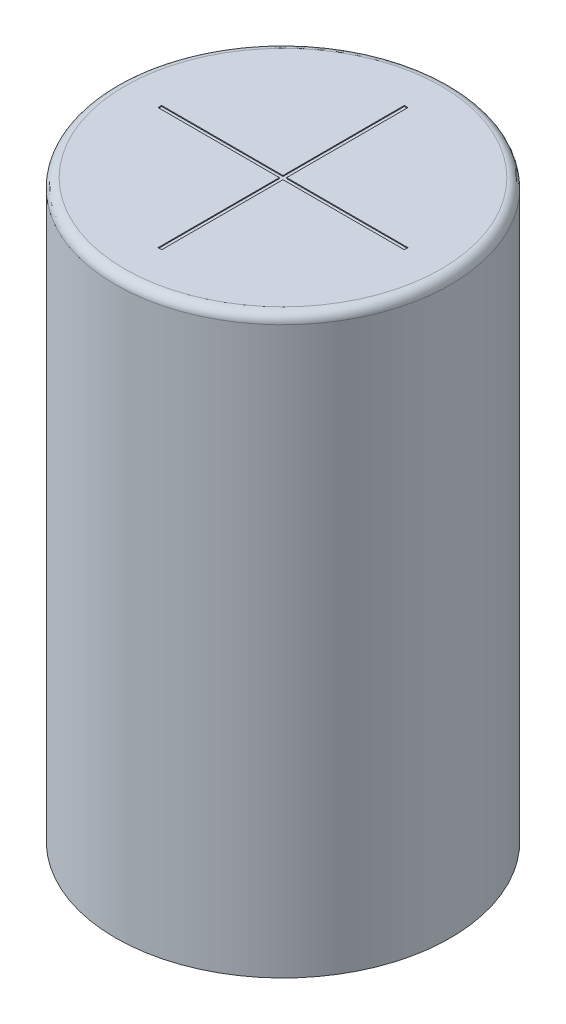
ISO-10303-21;
HEADER;
FILE_DESCRIPTION(('STEP AP214'),'2;1');
FILE_NAME('part.step','',(''),(''),'','','');
FILE_SCHEMA(('AUTOMOTIVE_DESIGN { 1 0 10303 214 1 1 1 1 }'));
ENDSEC;
DATA;
#1=APPLICATION_CONTEXT('core data for automotive mechanical design processes');
#2=APPLICATION_PROTOCOL_DEFINITION('international standard','automotive_design',2000,#1);
#3=PRODUCT_CONTEXT('',#1,'mechanical');
#4=PRODUCT('Part','Part','',(#3));
#5=PRODUCT_RELATED_PRODUCT_CATEGORY('part','',(#4));
#6=PRODUCT_DEFINITION_FORMATION('','',#4);
#7=PRODUCT_DEFINITION_CONTEXT('part definition',#1,'design');
#8=PRODUCT_DEFINITION('design','',#6,#7);
#9=PRODUCT_DEFINITION_SHAPE('','',#8);
#10=(LENGTH_UNIT() NAMED_UNIT(*) SI_UNIT(.MILLI.,.METRE.));
#11=(NAMED_UNIT(*) PLANE_ANGLE_UNIT() SI_UNIT($,.RADIAN.));
#12=(NAMED_UNIT(*) SI_UNIT($,.STERADIAN.) SOLID_ANGLE_UNIT());
#13=UNCERTAINTY_MEASURE_WITH_UNIT(LENGTH_MEASURE(1.E-05),#10,'distance_accuracy_value','');
#14=(GEOMETRIC_REPRESENTATION_CONTEXT(3) GLOBAL_UNCERTAINTY_ASSIGNED_CONTEXT((#13)) GLOBAL_UNIT_ASSIGNED_CONTEXT((#10,
#11,#12)) REPRESENTATION_CONTEXT('',''));
#15=CARTESIAN_POINT('',(0.,0.,0.));
#16=DIRECTION('',(0.,0.,1.));
#17=DIRECTION('',(1.,0.,0.));
#18=AXIS2_PLACEMENT_3D('',#15,#16,#17);
#19=CARTESIAN_POINT('',(0.,31.45,0.));
#20=DIRECTION('',(0.,1.,0.));
#21=DIRECTION('',(0.,0.,1.));
#22=AXIS2_PLACEMENT_3D('',#19,#20,#21);
#23=CYLINDRICAL_SURFACE('',#22,6.75);
#24=CARTESIAN_POINT('',(0.,31.45,0.));
#25=DIRECTION('',(0.,1.,0.));
#26=DIRECTION('',(0.,0.,1.));
#27=AXIS2_PLACEMENT_3D('',#24,#25,#26);
#28=CIRCLE('',#27,6.75);
#29=CARTESIAN_POINT('',(-0.1,31.45,6.74925921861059));
#30=VERTEX_POINT('',#29);
#31=CARTESIAN_POINT('',(0.100000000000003,31.45,6.74925921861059));
#32=VERTEX_POINT('',#31);
#33=EDGE_CURVE('E103',#30,#32,#28,.T.);
#34=ORIENTED_EDGE('',*,*,#33,.F.);
#35=DIRECTION('',(0.,1.,0.));
#36=VECTOR('',#35,1.);
#37=CARTESIAN_POINT('',(-0.1,31.45,6.74925921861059));
#38=LINE('',#37,#36);
#39=CARTESIAN_POINT('',(-0.1,31.5,6.74925921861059));
#40=VERTEX_POINT('',#39);
#41=EDGE_CURVE('E114',#30,#40,#38,.T.);
#42=ORIENTED_EDGE('',*,*,#41,.T.);
#43=CARTESIAN_POINT('',(0.,31.5,0.));
#44=DIRECTION('',(0.,1.,0.));
#45=DIRECTION('',(0.,0.,1.));
#46=AXIS2_PLACEMENT_3D('',#43,#44,#45);
#47=CIRCLE('',#46,6.75);
#48=CARTESIAN_POINT('',(0.100000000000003,31.5,6.74925921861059));
#49=VERTEX_POINT('',#48);
#50=EDGE_CURVE('E11',#40,#49,#47,.T.);
#51=ORIENTED_EDGE('',*,*,#50,.T.);
#52=DIRECTION('',(0.,1.,0.));
#53=VECTOR('',#52,1.);
#54=CARTESIAN_POINT('',(0.100000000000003,31.45,6.74925921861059));
#55=LINE('',#54,#53);
#56=EDGE_CURVE('E36',#32,#49,#55,.T.);
#57=ORIENTED_EDGE('',*,*,#56,.F.);
#58=EDGE_LOOP('',(#34,#42,#51,#57));
#59=FACE_BOUND('',#58,.T.);
#60=ADVANCED_FACE('F17',(#59),#23,.F.);
#61=CARTESIAN_POINT('',(0.,31.,0.));
#62=DIRECTION('',(0.,1.,0.));
#63=DIRECTION('',(0.,0.,1.));
#64=AXIS2_PLACEMENT_3D('',#61,#62,#63);
#65=TOROIDAL_SURFACE('',#64,8.675,0.5);
#66=CARTESIAN_POINT('',(0.,31.5,0.));
#67=DIRECTION('',(0.,1.,0.));
#68=DIRECTION('',(0.,0.,1.));
#69=AXIS2_PLACEMENT_3D('',#66,#67,#68);
#70=CIRCLE('',#69,8.675);
#71=CARTESIAN_POINT('',(0.,31.5,8.675));
#72=VERTEX_POINT('',#71);
#73=EDGE_CURVE('E196',#72,#72,#70,.T.);
#74=ORIENTED_EDGE('',*,*,#73,.F.);
#75=EDGE_LOOP('',(#74));
#76=FACE_BOUND('',#75,.T.);
#77=CARTESIAN_POINT('',(0.,31.,0.));
#78=DIRECTION('',(0.,-1.,0.));
#79=DIRECTION('',(0.,0.,1.));
#80=AXIS2_PLACEMENT_3D('',#77,#78,#79);
#81=CIRCLE('',#80,9.175);
#82=CARTESIAN_POINT('',(0.,31.,9.175));
#83=VERTEX_POINT('',#82);
#84=EDGE_CURVE('E27',#83,#83,#81,.T.);
#85=ORIENTED_EDGE('',*,*,#84,.F.);
#86=EDGE_LOOP('',(#85));
#87=FACE_BOUND('',#86,.T.);
#88=ADVANCED_FACE('F252',(#76,#87),#65,.T.);
#89=CARTESIAN_POINT('',(0.,31.5,0.));
#90=DIRECTION('',(0.,-1.,0.));
#91=DIRECTION('',(0.,0.,-1.));
#92=AXIS2_PLACEMENT_3D('',#89,#90,#91);
#93=CYLINDRICAL_SURFACE('',#92,9.175);
#94=CARTESIAN_POINT('',(0.,0.,0.));
#95=DIRECTION('',(0.,1.,0.));
#96=DIRECTION('',(0.,0.,1.));
#97=AXIS2_PLACEMENT_3D('',#94,#95,#96);
#98=CIRCLE('',#97,9.175);
#99=CARTESIAN_POINT('',(0.,0.,9.175));
#100=VERTEX_POINT('',#99);
#101=EDGE_CURVE('E203',#100,#100,#98,.T.);
#102=ORIENTED_EDGE('',*,*,#101,.T.);
#103=EDGE_LOOP('',(#102));
#104=FACE_BOUND('',#103,.T.);
#105=ORIENTED_EDGE('',*,*,#84,.T.);
#106=EDGE_LOOP('',(#105));
#107=FACE_BOUND('',#106,.T.);
#108=ADVANCED_FACE('F248',(#104,#107),#93,.T.);
#109=CARTESIAN_POINT('',(0.,31.5,0.));
#110=DIRECTION('',(0.,1.,0.));
#111=DIRECTION('',(0.,0.,1.));
#112=AXIS2_PLACEMENT_3D('',#109,#110,#111);
#113=PLANE('',#112);
#114=DIRECTION('',(-1.,0.,0.));
#115=VECTOR('',#114,1.);
#116=CARTESIAN_POINT('',(-0.1,31.5,-0.1));
#117=LINE('',#116,#115);
#118=CARTESIAN_POINT('',(-0.1,31.5,-0.1));
#119=VERTEX_POINT('',#118);
#120=CARTESIAN_POINT('',(-6.74925921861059,31.5,-0.1));
#121=VERTEX_POINT('',#120);
#122=EDGE_CURVE('E137',#119,#121,#117,.T.);
#123=ORIENTED_EDGE('',*,*,#122,.F.);
#124=DIRECTION('',(0.,0.,1.));
#125=VECTOR('',#124,1.);
#126=CARTESIAN_POINT('',(-0.1,31.5,-0.1));
#127=LINE('',#126,#125);
#128=CARTESIAN_POINT('',(-0.0999999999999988,31.5,-6.74925921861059));
#129=VERTEX_POINT('',#128);
#130=EDGE_CURVE('E144',#129,#119,#127,.T.);
#131=ORIENTED_EDGE('',*,*,#130,.F.);
#132=CARTESIAN_POINT('',(0.,31.5,0.));
#133=DIRECTION('',(0.,1.,0.));
#134=DIRECTION('',(0.,0.,1.));
#135=AXIS2_PLACEMENT_3D('',#132,#133,#134);
#136=CIRCLE('',#135,6.75);
#137=CARTESIAN_POINT('',(0.1,31.5,-6.74925921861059));
#138=VERTEX_POINT('',#137);
#139=EDGE_CURVE('E151',#138,#129,#136,.T.);
#140=ORIENTED_EDGE('',*,*,#139,.F.);
#141=DIRECTION('',(0.,0.,-1.));
#142=VECTOR('',#141,1.);
#143=CARTESIAN_POINT('',(0.1,31.5,-0.1));
#144=LINE('',#143,#142);
#145=CARTESIAN_POINT('',(0.1,31.5,-0.1));
#146=VERTEX_POINT('',#145);
#147=EDGE_CURVE('E158',#146,#138,#144,.T.);
#148=ORIENTED_EDGE('',*,*,#147,.F.);
#149=DIRECTION('',(-1.,0.,0.));
#150=VECTOR('',#149,1.);
#151=CARTESIAN_POINT('',(6.74925921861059,31.5,-0.1));
#152=LINE('',#151,#150);
#153=CARTESIAN_POINT('',(6.74925921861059,31.5,-0.100000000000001));
#154=VERTEX_POINT('',#153);
#155=EDGE_CURVE('E165',#154,#146,#152,.T.);
#156=ORIENTED_EDGE('',*,*,#155,.F.);
#157=CARTESIAN_POINT('',(0.,31.5,0.));
#158=DIRECTION('',(0.,1.,0.));
#159=DIRECTION('',(0.,0.,1.));
#160=AXIS2_PLACEMENT_3D('',#157,#158,#159);
#161=CIRCLE('',#160,6.75);
#162=CARTESIAN_POINT('',(6.74925921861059,31.5,0.1));
#163=VERTEX_POINT('',#162);
#164=EDGE_CURVE('E172',#163,#154,#161,.T.);
#165=ORIENTED_EDGE('',*,*,#164,.F.);
#166=DIRECTION('',(1.,0.,0.));
#167=VECTOR('',#166,1.);
#168=CARTESIAN_POINT('',(6.74925921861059,31.5,0.1));
#169=LINE('',#168,#167);
#170=CARTESIAN_POINT('',(0.1,31.5,0.1));
#171=VERTEX_POINT('',#170);
#172=EDGE_CURVE('E179',#171,#163,#169,.T.);
#173=ORIENTED_EDGE('',*,*,#172,.F.);
#174=DIRECTION('',(0.,0.,-1.));
#175=VECTOR('',#174,1.);
#176=CARTESIAN_POINT('',(0.1,31.5,6.74925921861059));
#177=LINE('',#176,#175);
#178=EDGE_CURVE('E186',#49,#171,#177,.T.);
#179=ORIENTED_EDGE('',*,*,#178,.F.);
#180=ORIENTED_EDGE('',*,*,#50,.F.);
#181=DIRECTION('',(0.,0.,1.));
#182=VECTOR('',#181,1.);
#183=CARTESIAN_POINT('',(-0.1,31.5,6.74925921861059));
#184=LINE('',#183,#182);
#185=CARTESIAN_POINT('',(-0.1,31.5,0.1));
#186=VERTEX_POINT('',#185);
#187=EDGE_CURVE('E124',#186,#40,#184,.T.);
#188=ORIENTED_EDGE('',*,*,#187,.F.);
#189=DIRECTION('',(1.,0.,0.));
#190=VECTOR('',#189,1.);
#191=CARTESIAN_POINT('',(-0.1,31.5,0.1));
#192=LINE('',#191,#190);
#193=CARTESIAN_POINT('',(-6.74925921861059,31.5,0.1));
#194=VERTEX_POINT('',#193);
#195=EDGE_CURVE('E122',#194,#186,#192,.T.);
#196=ORIENTED_EDGE('',*,*,#195,.F.);
#197=CARTESIAN_POINT('',(0.,31.5,0.));
#198=DIRECTION('',(0.,1.,0.));
#199=DIRECTION('',(0.,0.,1.));
#200=AXIS2_PLACEMENT_3D('',#197,#198,#199);
#201=CIRCLE('',#200,6.75);
#202=EDGE_CURVE('E136',#121,#194,#201,.T.);
#203=ORIENTED_EDGE('',*,*,#202,.F.);
#204=EDGE_LOOP('',(#123,#131,#140,#148,#156,#165,#173,#179,#180,#188,#196,#203));
#205=FACE_BOUND('',#204,.T.);
#206=ORIENTED_EDGE('',*,*,#73,.T.);
#207=EDGE_LOOP('',(#206));
#208=FACE_BOUND('',#207,.T.);
#209=ADVANCED_FACE('F244',(#205,#208),#113,.T.);
#210=CARTESIAN_POINT('',(0.,0.,0.));
#211=DIRECTION('',(0.,1.,0.));
#212=DIRECTION('',(0.,0.,1.));
#213=AXIS2_PLACEMENT_3D('',#210,#211,#212);
#214=PLANE('',#213);
#215=ORIENTED_EDGE('',*,*,#101,.F.);
#216=EDGE_LOOP('',(#215));
#217=FACE_BOUND('',#216,.T.);
#218=ADVANCED_FACE('F247',(#217),#214,.F.);
#219=CARTESIAN_POINT('',(0.,31.45,0.));
#220=DIRECTION('',(0.,1.,0.));
#221=DIRECTION('',(0.,0.,1.));
#222=AXIS2_PLACEMENT_3D('',#219,#220,#221);
#223=CYLINDRICAL_SURFACE('',#222,6.75);
#224=ORIENTED_EDGE('',*,*,#202,.T.);
#225=DIRECTION('',(0.,1.,0.));
#226=VECTOR('',#225,1.);
#227=CARTESIAN_POINT('',(-6.74925921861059,31.45,0.1));
#228=LINE('',#227,#226);
#229=CARTESIAN_POINT('',(-6.74925921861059,31.45,0.1));
#230=VERTEX_POINT('',#229);
#231=EDGE_CURVE('E128',#230,#194,#228,.T.);
#232=ORIENTED_EDGE('',*,*,#231,.F.);
#233=CARTESIAN_POINT('',(0.,31.45,0.));
#234=DIRECTION('',(0.,1.,0.));
#235=DIRECTION('',(0.,0.,1.));
#236=AXIS2_PLACEMENT_3D('',#233,#234,#235);
#237=CIRCLE('',#236,6.75);
#238=CARTESIAN_POINT('',(-6.74925921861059,31.45,-0.1));
#239=VERTEX_POINT('',#238);
#240=EDGE_CURVE('E126',#239,#230,#237,.T.);
#241=ORIENTED_EDGE('',*,*,#240,.F.);
#242=DIRECTION('',(0.,1.,0.));
#243=VECTOR('',#242,1.);
#244=CARTESIAN_POINT('',(-6.74925921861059,31.45,-0.1));
#245=LINE('',#244,#243);
#246=EDGE_CURVE('E133',#239,#121,#245,.T.);
#247=ORIENTED_EDGE('',*,*,#246,.T.);
#248=EDGE_LOOP('',(#224,#232,#241,#247));
#249=FACE_BOUND('',#248,.T.);
#250=ADVANCED_FACE('F242',(#249),#223,.F.);
#251=CARTESIAN_POINT('',(-0.1,31.45,-0.1));
#252=DIRECTION('',(0.,0.,-1.));
#253=DIRECTION('',(-1.,0.,0.));
#254=AXIS2_PLACEMENT_3D('',#251,#252,#253);
#255=PLANE('',#254);
#256=ORIENTED_EDGE('',*,*,#122,.T.);
#257=ORIENTED_EDGE('',*,*,#246,.F.);
#258=DIRECTION('',(-1.,0.,0.));
#259=VECTOR('',#258,1.);
#260=CARTESIAN_POINT('',(-0.1,31.45,-0.1));
#261=LINE('',#260,#259);
#262=CARTESIAN_POINT('',(-0.1,31.45,-0.1));
#263=VERTEX_POINT('',#262);
#264=EDGE_CURVE('E138',#263,#239,#261,.T.);
#265=ORIENTED_EDGE('',*,*,#264,.F.);
#266=DIRECTION('',(0.,1.,0.));
#267=VECTOR('',#266,1.);
#268=CARTESIAN_POINT('',(-0.1,31.45,-0.1));
#269=LINE('',#268,#267);
#270=EDGE_CURVE('E141',#263,#119,#269,.T.);
#271=ORIENTED_EDGE('',*,*,#270,.T.);
#272=EDGE_LOOP('',(#256,#257,#265,#271));
#273=FACE_BOUND('',#272,.T.);
#274=ADVANCED_FACE('F238',(#273),#255,.F.);
#275=CARTESIAN_POINT('',(-0.1,31.45,-0.1));
#276=DIRECTION('',(-1.,0.,0.));
#277=DIRECTION('',(0.,0.,1.));
#278=AXIS2_PLACEMENT_3D('',#275,#276,#277);
#279=PLANE('',#278);
#280=ORIENTED_EDGE('',*,*,#130,.T.);
#281=ORIENTED_EDGE('',*,*,#270,.F.);
#282=DIRECTION('',(0.,0.,1.));
#283=VECTOR('',#282,1.);
#284=CARTESIAN_POINT('',(-0.1,31.45,-0.1));
#285=LINE('',#284,#283);
#286=CARTESIAN_POINT('',(-0.0999999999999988,31.45,-6.74925921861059));
#287=VERTEX_POINT('',#286);
#288=EDGE_CURVE('E140',#287,#263,#285,.T.);
#289=ORIENTED_EDGE('',*,*,#288,.F.);
#290=DIRECTION('',(0.,1.,0.));
#291=VECTOR('',#290,1.);
#292=CARTESIAN_POINT('',(-0.0999999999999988,31.45,-6.74925921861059));
#293=LINE('',#292,#291);
#294=EDGE_CURVE('E148',#287,#129,#293,.T.);
#295=ORIENTED_EDGE('',*,*,#294,.T.);
#296=EDGE_LOOP('',(#280,#281,#289,#295));
#297=FACE_BOUND('',#296,.T.);
#298=ADVANCED_FACE('F234',(#297),#279,.F.);
#299=CARTESIAN_POINT('',(0.,31.45,0.));
#300=DIRECTION('',(0.,1.,0.));
#301=DIRECTION('',(0.,0.,1.));
#302=AXIS2_PLACEMENT_3D('',#299,#300,#301);
#303=CYLINDRICAL_SURFACE('',#302,6.75);
#304=ORIENTED_EDGE('',*,*,#139,.T.);
#305=ORIENTED_EDGE('',*,*,#294,.F.);
#306=CARTESIAN_POINT('',(0.,31.45,0.));
#307=DIRECTION('',(0.,1.,0.));
#308=DIRECTION('',(0.,0.,1.));
#309=AXIS2_PLACEMENT_3D('',#306,#307,#308);
#310=CIRCLE('',#309,6.75);
#311=CARTESIAN_POINT('',(0.1,31.45,-6.74925921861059));
#312=VERTEX_POINT('',#311);
#313=EDGE_CURVE('E147',#312,#287,#310,.T.);
#314=ORIENTED_EDGE('',*,*,#313,.F.);
#315=DIRECTION('',(0.,1.,0.));
#316=VECTOR('',#315,1.);
#317=CARTESIAN_POINT('',(0.1,31.45,-6.74925921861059));
#318=LINE('',#317,#316);
#319=EDGE_CURVE('E155',#312,#138,#318,.T.);
#320=ORIENTED_EDGE('',*,*,#319,.T.);
#321=EDGE_LOOP('',(#304,#305,#314,#320));
#322=FACE_BOUND('',#321,.T.);
#323=ADVANCED_FACE('F231',(#322),#303,.F.);
#324=CARTESIAN_POINT('',(0.1,31.45,-0.1));
#325=DIRECTION('',(1.,0.,0.));
#326=DIRECTION('',(0.,0.,-1.));
#327=AXIS2_PLACEMENT_3D('',#324,#325,#326);
#328=PLANE('',#327);
#329=ORIENTED_EDGE('',*,*,#147,.T.);
#330=ORIENTED_EDGE('',*,*,#319,.F.);
#331=DIRECTION('',(0.,0.,-1.));
#332=VECTOR('',#331,1.);
#333=CARTESIAN_POINT('',(0.1,31.45,-0.1));
#334=LINE('',#333,#332);
#335=CARTESIAN_POINT('',(0.1,31.45,-0.1));
#336=VERTEX_POINT('',#335);
#337=EDGE_CURVE('E154',#336,#312,#334,.T.);
#338=ORIENTED_EDGE('',*,*,#337,.F.);
#339=DIRECTION('',(0.,1.,0.));
#340=VECTOR('',#339,1.);
#341=CARTESIAN_POINT('',(0.1,31.45,-0.1));
#342=LINE('',#341,#340);
#343=EDGE_CURVE('E162',#336,#146,#342,.T.);
#344=ORIENTED_EDGE('',*,*,#343,.T.);
#345=EDGE_LOOP('',(#329,#330,#338,#344));
#346=FACE_BOUND('',#345,.T.);
#347=ADVANCED_FACE('F226',(#346),#328,.F.);
#348=CARTESIAN_POINT('',(6.74925921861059,31.45,-0.1));
#349=DIRECTION('',(0.,0.,-1.));
#350=DIRECTION('',(-1.,0.,0.));
#351=AXIS2_PLACEMENT_3D('',#348,#349,#350);
#352=PLANE('',#351);
#353=ORIENTED_EDGE('',*,*,#155,.T.);
#354=ORIENTED_EDGE('',*,*,#343,.F.);
#355=DIRECTION('',(-1.,0.,0.));
#356=VECTOR('',#355,1.);
#357=CARTESIAN_POINT('',(6.74925921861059,31.45,-0.1));
#358=LINE('',#357,#356);
#359=CARTESIAN_POINT('',(6.74925921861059,31.45,-0.100000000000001));
#360=VERTEX_POINT('',#359);
#361=EDGE_CURVE('E161',#360,#336,#358,.T.);
#362=ORIENTED_EDGE('',*,*,#361,.F.);
#363=DIRECTION('',(0.,1.,0.));
#364=VECTOR('',#363,1.);
#365=CARTESIAN_POINT('',(6.74925921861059,31.45,-0.100000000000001));
#366=LINE('',#365,#364);
#367=EDGE_CURVE('E169',#360,#154,#366,.T.);
#368=ORIENTED_EDGE('',*,*,#367,.T.);
#369=EDGE_LOOP('',(#353,#354,#362,#368));
#370=FACE_BOUND('',#369,.T.);
#371=ADVANCED_FACE('F222',(#370),#352,.F.);
#372=CARTESIAN_POINT('',(0.,31.45,0.));
#373=DIRECTION('',(0.,1.,0.));
#374=DIRECTION('',(0.,0.,1.));
#375=AXIS2_PLACEMENT_3D('',#372,#373,#374);
#376=CYLINDRICAL_SURFACE('',#375,6.75);
#377=ORIENTED_EDGE('',*,*,#164,.T.);
#378=ORIENTED_EDGE('',*,*,#367,.F.);
#379=CARTESIAN_POINT('',(0.,31.45,0.));
#380=DIRECTION('',(0.,1.,0.));
#381=DIRECTION('',(0.,0.,1.));
#382=AXIS2_PLACEMENT_3D('',#379,#380,#381);
#383=CIRCLE('',#382,6.75);
#384=CARTESIAN_POINT('',(6.74925921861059,31.45,0.1));
#385=VERTEX_POINT('',#384);
#386=EDGE_CURVE('E168',#385,#360,#383,.T.);
#387=ORIENTED_EDGE('',*,*,#386,.F.);
#388=DIRECTION('',(0.,1.,0.));
#389=VECTOR('',#388,1.);
#390=CARTESIAN_POINT('',(6.74925921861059,31.45,0.1));
#391=LINE('',#390,#389);
#392=EDGE_CURVE('E176',#385,#163,#391,.T.);
#393=ORIENTED_EDGE('',*,*,#392,.T.);
#394=EDGE_LOOP('',(#377,#378,#387,#393));
#395=FACE_BOUND('',#394,.T.);
#396=ADVANCED_FACE('F219',(#395),#376,.F.);
#397=CARTESIAN_POINT('',(6.74925921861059,31.45,0.1));
#398=DIRECTION('',(0.,0.,1.));
#399=DIRECTION('',(1.,0.,0.));
#400=AXIS2_PLACEMENT_3D('',#397,#398,#399);
#401=PLANE('',#400);
#402=ORIENTED_EDGE('',*,*,#172,.T.);
#403=ORIENTED_EDGE('',*,*,#392,.F.);
#404=DIRECTION('',(1.,0.,0.));
#405=VECTOR('',#404,1.);
#406=CARTESIAN_POINT('',(6.74925921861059,31.45,0.1));
#407=LINE('',#406,#405);
#408=CARTESIAN_POINT('',(0.1,31.45,0.1));
#409=VERTEX_POINT('',#408);
#410=EDGE_CURVE('E175',#409,#385,#407,.T.);
#411=ORIENTED_EDGE('',*,*,#410,.F.);
#412=DIRECTION('',(0.,1.,0.));
#413=VECTOR('',#412,1.);
#414=CARTESIAN_POINT('',(0.1,31.45,0.1));
#415=LINE('',#414,#413);
#416=EDGE_CURVE('E183',#409,#171,#415,.T.);
#417=ORIENTED_EDGE('',*,*,#416,.T.);
#418=EDGE_LOOP('',(#402,#403,#411,#417));
#419=FACE_BOUND('',#418,.T.);
#420=ADVANCED_FACE('F214',(#419),#401,.F.);
#421=CARTESIAN_POINT('',(0.1,31.45,6.74925921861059));
#422=DIRECTION('',(1.,0.,0.));
#423=DIRECTION('',(0.,0.,-1.));
#424=AXIS2_PLACEMENT_3D('',#421,#422,#423);
#425=PLANE('',#424);
#426=ORIENTED_EDGE('',*,*,#178,.T.);
#427=ORIENTED_EDGE('',*,*,#416,.F.);
#428=DIRECTION('',(0.,0.,-1.));
#429=VECTOR('',#428,1.);
#430=CARTESIAN_POINT('',(0.1,31.45,6.74925921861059));
#431=LINE('',#430,#429);
#432=EDGE_CURVE('E182',#32,#409,#431,.T.);
#433=ORIENTED_EDGE('',*,*,#432,.F.);
#434=ORIENTED_EDGE('',*,*,#56,.T.);
#435=EDGE_LOOP('',(#426,#427,#433,#434));
#436=FACE_BOUND('',#435,.T.);
#437=ADVANCED_FACE('F211',(#436),#425,.F.);
#438=CARTESIAN_POINT('',(-0.1,31.45,6.74925921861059));
#439=DIRECTION('',(-1.,0.,0.));
#440=DIRECTION('',(0.,0.,1.));
#441=AXIS2_PLACEMENT_3D('',#438,#439,#440);
#442=PLANE('',#441);
#443=ORIENTED_EDGE('',*,*,#187,.T.);
#444=ORIENTED_EDGE('',*,*,#41,.F.);
#445=DIRECTION('',(0.,0.,1.));
#446=VECTOR('',#445,1.);
#447=CARTESIAN_POINT('',(-0.1,31.45,6.74925921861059));
#448=LINE('',#447,#446);
#449=CARTESIAN_POINT('',(-0.1,31.45,0.1));
#450=VERTEX_POINT('',#449);
#451=EDGE_CURVE('E109',#450,#30,#448,.T.);
#452=ORIENTED_EDGE('',*,*,#451,.F.);
#453=DIRECTION('',(0.,1.,0.));
#454=VECTOR('',#453,1.);
#455=CARTESIAN_POINT('',(-0.1,31.45,0.1));
#456=LINE('',#455,#454);
#457=EDGE_CURVE('E113',#450,#186,#456,.T.);
#458=ORIENTED_EDGE('',*,*,#457,.T.);
#459=EDGE_LOOP('',(#443,#444,#452,#458));
#460=FACE_BOUND('',#459,.T.);
#461=ADVANCED_FACE('F112',(#460),#442,.F.);
#462=CARTESIAN_POINT('',(-0.1,31.45,0.1));
#463=DIRECTION('',(0.,0.,1.));
#464=DIRECTION('',(1.,0.,0.));
#465=AXIS2_PLACEMENT_3D('',#462,#463,#464);
#466=PLANE('',#465);
#467=ORIENTED_EDGE('',*,*,#195,.T.);
#468=ORIENTED_EDGE('',*,*,#457,.F.);
#469=DIRECTION('',(1.,0.,0.));
#470=VECTOR('',#469,1.);
#471=CARTESIAN_POINT('',(-0.1,31.45,0.1));
#472=LINE('',#471,#470);
#473=EDGE_CURVE('E21',#230,#450,#472,.T.);
#474=ORIENTED_EDGE('',*,*,#473,.F.);
#475=ORIENTED_EDGE('',*,*,#231,.T.);
#476=EDGE_LOOP('',(#467,#468,#474,#475));
#477=FACE_BOUND('',#476,.T.);
#478=ADVANCED_FACE('F120',(#477),#466,.F.);
#479=CARTESIAN_POINT('',(0.,31.45,0.));
#480=DIRECTION('',(0.,1.,0.));
#481=DIRECTION('',(0.,0.,1.));
#482=AXIS2_PLACEMENT_3D('',#479,#480,#481);
#483=PLANE('',#482);
#484=ORIENTED_EDGE('',*,*,#240,.T.);
#485=ORIENTED_EDGE('',*,*,#473,.T.);
#486=ORIENTED_EDGE('',*,*,#451,.T.);
#487=ORIENTED_EDGE('',*,*,#33,.T.);
#488=ORIENTED_EDGE('',*,*,#432,.T.);
#489=ORIENTED_EDGE('',*,*,#410,.T.);
#490=ORIENTED_EDGE('',*,*,#386,.T.);
#491=ORIENTED_EDGE('',*,*,#361,.T.);
#492=ORIENTED_EDGE('',*,*,#337,.T.);
#493=ORIENTED_EDGE('',*,*,#313,.T.);
#494=ORIENTED_EDGE('',*,*,#288,.T.);
#495=ORIENTED_EDGE('',*,*,#264,.T.);
#496=EDGE_LOOP('',(#484,#485,#486,#487,#488,#489,#490,#491,#492,#493,#494,#495));
#497=FACE_BOUND('',#496,.T.);
#498=ADVANCED_FACE('F19',(#497),#483,.T.);
#499=CLOSED_SHELL('',(#60,#88,#108,#209,#218,#250,#274,#298,#323,#347,#371,#396,#420,#437,#461,
#478,#498));
#500=MANIFOLD_SOLID_BREP('B1',#499);
#501=ADVANCED_BREP_SHAPE_REPRESENTATION('',(#18,#500),#14);
#502=SHAPE_DEFINITION_REPRESENTATION(#9,#501);
ENDSEC;
END-ISO-10303-21;
